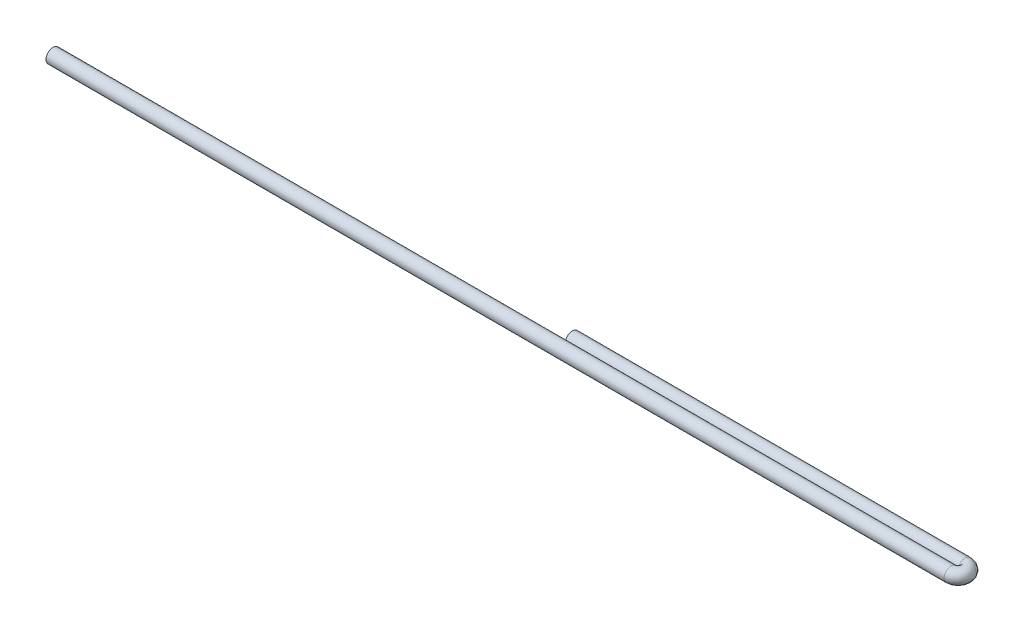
ISO-10303-21;
HEADER;
FILE_DESCRIPTION(('STEP AP214'),'2;1');
FILE_NAME('part.step','',(''),(''),'','','');
FILE_SCHEMA(('AUTOMOTIVE_DESIGN { 1 0 10303 214 1 1 1 1 }'));
ENDSEC;
DATA;
#1=APPLICATION_CONTEXT('core data for automotive mechanical design processes');
#2=APPLICATION_PROTOCOL_DEFINITION('international standard','automotive_design',2000,#1);
#3=PRODUCT_CONTEXT('',#1,'mechanical');
#4=PRODUCT('Part','Part','',(#3));
#5=PRODUCT_RELATED_PRODUCT_CATEGORY('part','',(#4));
#6=PRODUCT_DEFINITION_FORMATION('','',#4);
#7=PRODUCT_DEFINITION_CONTEXT('part definition',#1,'design');
#8=PRODUCT_DEFINITION('design','',#6,#7);
#9=PRODUCT_DEFINITION_SHAPE('','',#8);
#10=(LENGTH_UNIT() NAMED_UNIT(*) SI_UNIT(.MILLI.,.METRE.));
#11=(NAMED_UNIT(*) PLANE_ANGLE_UNIT() SI_UNIT($,.RADIAN.));
#12=(NAMED_UNIT(*) SI_UNIT($,.STERADIAN.) SOLID_ANGLE_UNIT());
#13=UNCERTAINTY_MEASURE_WITH_UNIT(LENGTH_MEASURE(1.E-05),#10,'distance_accuracy_value','');
#14=(GEOMETRIC_REPRESENTATION_CONTEXT(3) GLOBAL_UNCERTAINTY_ASSIGNED_CONTEXT((#13)) GLOBAL_UNIT_ASSIGNED_CONTEXT((#10,
#11,#12)) REPRESENTATION_CONTEXT('',''));
#15=CARTESIAN_POINT('',(0.,0.,0.));
#16=DIRECTION('',(0.,0.,1.));
#17=DIRECTION('',(1.,0.,0.));
#18=AXIS2_PLACEMENT_3D('',#15,#16,#17);
#19=CARTESIAN_POINT('',(203.2,0.,-3.175));
#20=DIRECTION('',(-1.,0.,0.));
#21=DIRECTION('',(0.,0.,1.));
#22=AXIS2_PLACEMENT_3D('',#19,#20,#21);
#23=CYLINDRICAL_SURFACE('',#22,1.5875);
#24=CARTESIAN_POINT('',(114.3,0.,-3.17499999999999));
#25=DIRECTION('',(-1.,0.,0.));
#26=DIRECTION('',(0.,0.,1.));
#27=AXIS2_PLACEMENT_3D('',#24,#25,#26);
#28=CIRCLE('',#27,1.5875);
#29=CARTESIAN_POINT('',(114.3,0.,-1.58749999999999));
#30=VERTEX_POINT('',#29);
#31=EDGE_CURVE('E11',#30,#30,#28,.T.);
#32=ORIENTED_EDGE('',*,*,#31,.F.);
#33=EDGE_LOOP('',(#32));
#34=FACE_BOUND('',#33,.T.);
#35=CARTESIAN_POINT('',(203.2,0.,-3.175));
#36=DIRECTION('',(-1.,0.,0.));
#37=DIRECTION('',(0.,0.,1.));
#38=AXIS2_PLACEMENT_3D('',#35,#36,#37);
#39=CIRCLE('',#38,1.5875);
#40=CARTESIAN_POINT('',(203.2,0.,-1.5875));
#41=VERTEX_POINT('',#40);
#42=EDGE_CURVE('E32',#41,#41,#39,.T.);
#43=ORIENTED_EDGE('',*,*,#42,.T.);
#44=EDGE_LOOP('',(#43));
#45=FACE_BOUND('',#44,.T.);
#46=ADVANCED_FACE('F26',(#34,#45),#23,.T.);
#47=CARTESIAN_POINT('',(203.2,0.,0.));
#48=DIRECTION('',(-1.,0.,0.));
#49=DIRECTION('',(0.,0.,1.));
#50=AXIS2_PLACEMENT_3D('',#47,#48,#49);
#51=CIRCLE('',#50,1.5875);
#52=TRIMMED_CURVE('',#51,(PARAMETER_VALUE(-3.14159263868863)),
(PARAMETER_VALUE(3.14159263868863)),.T.,.PARAMETER.);
#53=CARTESIAN_POINT('',(203.2,0.,-1.5875));
#54=DIRECTION('',(0.,1.,0.));
#55=AXIS1_PLACEMENT('',#53,#54);
#56=SURFACE_OF_REVOLUTION('',#52,#55);
#57=CARTESIAN_POINT('',(203.2,0.,0.));
#58=DIRECTION('',(1.,0.,0.));
#59=DIRECTION('',(0.,0.,-1.));
#60=AXIS2_PLACEMENT_3D('',#57,#58,#59);
#61=CIRCLE('',#60,1.5875);
#62=EDGE_CURVE('E39',#41,#41,#61,.T.);
#63=ORIENTED_EDGE('',*,*,#62,.T.);
#64=ORIENTED_EDGE('',*,*,#42,.F.);
#65=EDGE_LOOP('',(#63,#64));
#66=FACE_BOUND('',#65,.T.);
#67=ADVANCED_FACE('F40',(#66),#56,.T.);
#68=CARTESIAN_POINT('',(203.2,0.,0.));
#69=DIRECTION('',(-1.,0.,0.));
#70=DIRECTION('',(0.,0.,1.));
#71=AXIS2_PLACEMENT_3D('',#68,#69,#70);
#72=CYLINDRICAL_SURFACE('',#71,1.5875);
#73=ORIENTED_EDGE('',*,*,#62,.F.);
#74=EDGE_LOOP('',(#73));
#75=FACE_BOUND('',#74,.T.);
#76=CARTESIAN_POINT('',(0.,0.,0.));
#77=DIRECTION('',(1.,0.,0.));
#78=DIRECTION('',(0.,0.,-1.));
#79=AXIS2_PLACEMENT_3D('',#76,#77,#78);
#80=CIRCLE('',#79,1.5875);
#81=CARTESIAN_POINT('',(0.,0.,-1.5875));
#82=VERTEX_POINT('',#81);
#83=EDGE_CURVE('E42',#82,#82,#80,.T.);
#84=ORIENTED_EDGE('',*,*,#83,.T.);
#85=EDGE_LOOP('',(#84));
#86=FACE_BOUND('',#85,.T.);
#87=ADVANCED_FACE('F48',(#75,#86),#72,.T.);
#88=CARTESIAN_POINT('',(114.3,0.,-3.17499999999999));
#89=DIRECTION('',(-1.,0.,0.));
#90=DIRECTION('',(0.,0.,1.));
#91=AXIS2_PLACEMENT_3D('',#88,#89,#90);
#92=PLANE('',#91);
#93=ORIENTED_EDGE('',*,*,#31,.T.);
#94=EDGE_LOOP('',(#93));
#95=FACE_BOUND('',#94,.T.);
#96=ADVANCED_FACE('F52',(#95),#92,.T.);
#97=CARTESIAN_POINT('',(0.,0.,0.));
#98=DIRECTION('',(1.,0.,0.));
#99=DIRECTION('',(0.,0.,-1.));
#100=AXIS2_PLACEMENT_3D('',#97,#98,#99);
#101=PLANE('',#100);
#102=ORIENTED_EDGE('',*,*,#83,.F.);
#103=EDGE_LOOP('',(#102));
#104=FACE_BOUND('',#103,.T.);
#105=ADVANCED_FACE('F50',(#104),#101,.F.);
#106=CLOSED_SHELL('',(#46,#67,#87,#96,#105));
#107=MANIFOLD_SOLID_BREP('B2',#106);
#108=ADVANCED_BREP_SHAPE_REPRESENTATION('',(#18,#107),#14);
#109=SHAPE_DEFINITION_REPRESENTATION(#9,#108);
ENDSEC;
END-ISO-10303-21;
